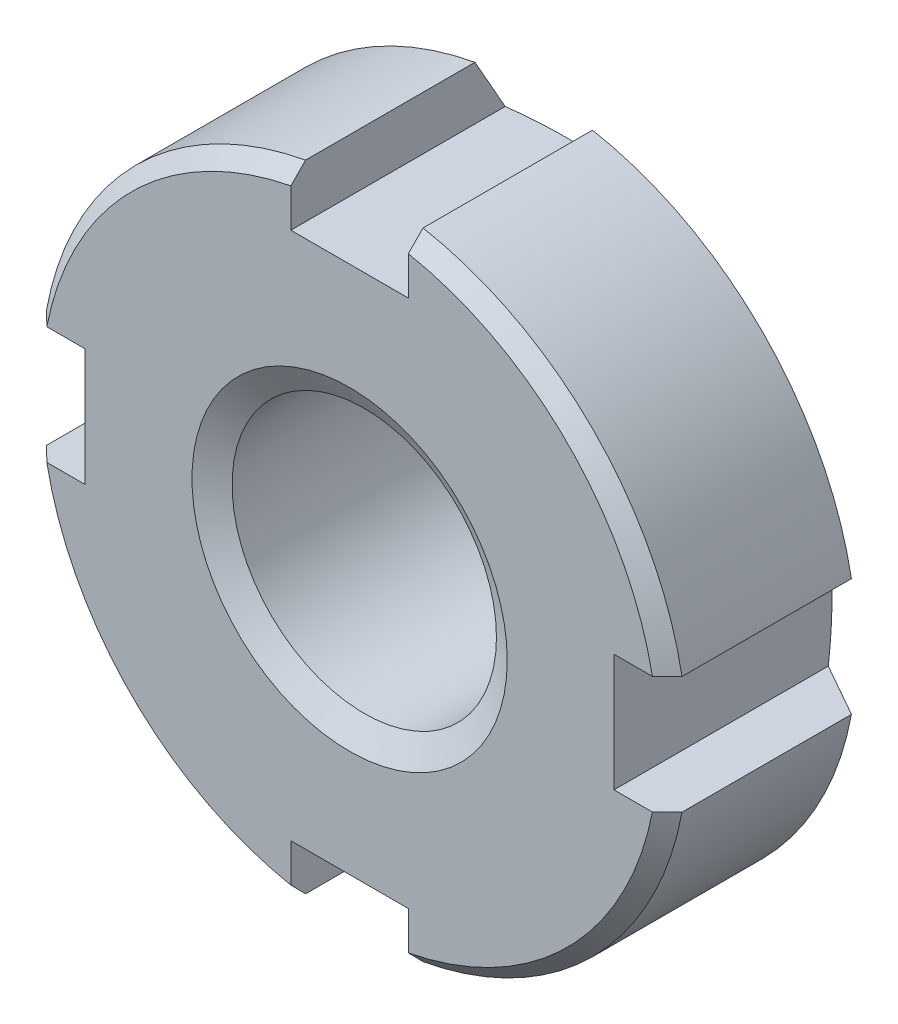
ISO-10303-21;
HEADER;
FILE_DESCRIPTION(('STEP AP214'),'2;1');
FILE_NAME('part.step','',(''),(''),'','','');
FILE_SCHEMA(('AUTOMOTIVE_DESIGN { 1 0 10303 214 1 1 1 1 }'));
ENDSEC;
DATA;
#1=APPLICATION_CONTEXT('core data for automotive mechanical design processes');
#2=APPLICATION_PROTOCOL_DEFINITION('international standard','automotive_design',2000,#1);
#3=PRODUCT_CONTEXT('',#1,'mechanical');
#4=PRODUCT('Part','Part','',(#3));
#5=PRODUCT_RELATED_PRODUCT_CATEGORY('part','',(#4));
#6=PRODUCT_DEFINITION_FORMATION('','',#4);
#7=PRODUCT_DEFINITION_CONTEXT('part definition',#1,'design');
#8=PRODUCT_DEFINITION('design','',#6,#7);
#9=PRODUCT_DEFINITION_SHAPE('','',#8);
#10=(LENGTH_UNIT() NAMED_UNIT(*) SI_UNIT(.MILLI.,.METRE.));
#11=(NAMED_UNIT(*) PLANE_ANGLE_UNIT() SI_UNIT($,.RADIAN.));
#12=(NAMED_UNIT(*) SI_UNIT($,.STERADIAN.) SOLID_ANGLE_UNIT());
#13=UNCERTAINTY_MEASURE_WITH_UNIT(LENGTH_MEASURE(1.E-05),#10,'distance_accuracy_value','');
#14=(GEOMETRIC_REPRESENTATION_CONTEXT(3) GLOBAL_UNCERTAINTY_ASSIGNED_CONTEXT((#13)) GLOBAL_UNIT_ASSIGNED_CONTEXT((#10,
#11,#12)) REPRESENTATION_CONTEXT('',''));
#15=CARTESIAN_POINT('',(0.,0.,0.));
#16=DIRECTION('',(0.,0.,1.));
#17=DIRECTION('',(1.,0.,0.));
#18=AXIS2_PLACEMENT_3D('',#15,#16,#17);
#19=CARTESIAN_POINT('',(0.,0.,-8.));
#20=DIRECTION('',(0.,0.,1.));
#21=DIRECTION('',(1.,0.,0.));
#22=AXIS2_PLACEMENT_3D('',#19,#20,#21);
#23=CYLINDRICAL_SURFACE('',#22,11.);
#24=DIRECTION('',(0.,0.,-1.));
#25=VECTOR('',#24,1.);
#26=CARTESIAN_POINT('',(-10.8166538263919,-2.00000000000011,0.));
#27=LINE('',#26,#25);
#28=CARTESIAN_POINT('',(-10.8166538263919,-2.00000000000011,-0.5));
#29=VERTEX_POINT('',#28);
#30=CARTESIAN_POINT('',(-10.8166538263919,-2.00000000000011,-6.26794919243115));
#31=VERTEX_POINT('',#30);
#32=EDGE_CURVE('E200',#29,#31,#27,.T.);
#33=ORIENTED_EDGE('',*,*,#32,.T.);
#34=CARTESIAN_POINT('',(0.,0.,-6.26794919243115));
#35=DIRECTION('',(0.,0.,-1.));
#36=DIRECTION('',(-1.,0.,0.));
#37=AXIS2_PLACEMENT_3D('',#34,#35,#36);
#38=CIRCLE('',#37,11.);
#39=CARTESIAN_POINT('',(-2.,-10.816653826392,-6.26794919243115));
#40=VERTEX_POINT('',#39);
#41=EDGE_CURVE('E485',#40,#31,#38,.T.);
#42=ORIENTED_EDGE('',*,*,#41,.F.);
#43=DIRECTION('',(0.,0.,-1.));
#44=VECTOR('',#43,1.);
#45=CARTESIAN_POINT('',(-2.,-10.816653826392,0.));
#46=LINE('',#45,#44);
#47=CARTESIAN_POINT('',(-2.,-10.816653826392,-0.5));
#48=VERTEX_POINT('',#47);
#49=EDGE_CURVE('E465',#48,#40,#46,.T.);
#50=ORIENTED_EDGE('',*,*,#49,.F.);
#51=CARTESIAN_POINT('',(0.,0.,-0.500000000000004));
#52=DIRECTION('',(0.,0.,1.));
#53=DIRECTION('',(1.,0.,0.));
#54=AXIS2_PLACEMENT_3D('',#51,#52,#53);
#55=CIRCLE('',#54,11.);
#56=EDGE_CURVE('E520',#48,#29,#55,.F.);
#57=ORIENTED_EDGE('',*,*,#56,.T.);
#58=EDGE_LOOP('',(#33,#42,#50,#57));
#59=FACE_BOUND('',#58,.T.);
#60=ADVANCED_FACE('F41',(#59),#23,.T.);
#61=CARTESIAN_POINT('',(0.,0.,0.));
#62=DIRECTION('',(0.,0.,-1.));
#63=DIRECTION('',(-1.,0.,0.));
#64=AXIS2_PLACEMENT_3D('',#61,#62,#63);
#65=CONICAL_SURFACE('',#64,10.5,0.785398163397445);
#66=CARTESIAN_POINT('',(-13.1380677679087,-2.00000000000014,-2.78942529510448));
#67=CARTESIAN_POINT('',(-12.7116462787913,-2.00000000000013,-2.36789004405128));
#68=CARTESIAN_POINT('',(-12.2850202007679,-2.00000000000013,-1.94656116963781));
#69=CARTESIAN_POINT('',(-11.4311341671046,-2.00000000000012,-1.10455061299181));
#70=CARTESIAN_POINT('',(-11.0038742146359,-2.00000000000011,-0.68386892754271));
#71=CARTESIAN_POINT('',(-10.148490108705,-2.0000000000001,0.156618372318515));
#72=CARTESIAN_POINT('',(-9.7203659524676,-2.0000000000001,0.576423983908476));
#73=CARTESIAN_POINT('',(-9.07722771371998,-2.00000000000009,1.20516089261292));
#74=CARTESIAN_POINT('',(-8.86268909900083,-2.00000000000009,1.41457846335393));
#75=CARTESIAN_POINT('',(-8.43321406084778,-2.00000000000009,1.83300575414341));
#76=CARTESIAN_POINT('',(-8.2182776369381,-2.00000000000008,2.04201547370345));
#77=CARTESIAN_POINT('',(-8.00310215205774,-2.00000000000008,2.25077918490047));
#78=B_SPLINE_CURVE_WITH_KNOTS('',3,(#66,#67,#68,#69,#70,#71,#72,#73,#74,#75,#76,#77),
.UNSPECIFIED.,.F.,.F.,(4,2,2,2,2,4),(0.,1.7988182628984,3.59762755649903,5.39644263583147,
6.29585464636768,7.19526773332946),.UNSPECIFIED.);
#79=CARTESIAN_POINT('',(-10.3077640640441,-2.00000000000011,0.));
#80=VERTEX_POINT('',#79);
#81=EDGE_CURVE('E224',#29,#80,#78,.T.);
#82=ORIENTED_EDGE('',*,*,#81,.F.);
#83=ORIENTED_EDGE('',*,*,#56,.F.);
#84=CARTESIAN_POINT('',(-2.,-8.00310215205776,2.25077918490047));
#85=CARTESIAN_POINT('',(-2.,-8.21827763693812,2.04201547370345));
#86=CARTESIAN_POINT('',(-2.,-8.43321406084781,1.83300575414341));
#87=CARTESIAN_POINT('',(-2.,-8.86268909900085,1.41457846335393));
#88=CARTESIAN_POINT('',(-2.,-9.07722771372,1.20516089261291));
#89=CARTESIAN_POINT('',(-2.,-9.72036595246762,0.576423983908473));
#90=CARTESIAN_POINT('',(-2.,-10.1484901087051,0.156618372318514));
#91=CARTESIAN_POINT('',(-2.,-11.003874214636,-0.68386892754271));
#92=CARTESIAN_POINT('',(-2.,-11.4311341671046,-1.10455061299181));
#93=CARTESIAN_POINT('',(-2.,-12.2850202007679,-1.94656116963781));
#94=CARTESIAN_POINT('',(-2.,-12.7116462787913,-2.36789004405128));
#95=CARTESIAN_POINT('',(-2.,-13.1380677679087,-2.78942529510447));
#96=B_SPLINE_CURVE_WITH_KNOTS('',3,(#84,#85,#86,#87,#88,#89,#90,#91,#92,#93,#94,#95),
.UNSPECIFIED.,.F.,.F.,(4,2,2,2,2,4),(0.,0.899413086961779,1.79882509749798,3.59764017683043,
5.39644947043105,7.19526773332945),.UNSPECIFIED.);
#97=CARTESIAN_POINT('',(-2.,-10.3077640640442,0.));
#98=VERTEX_POINT('',#97);
#99=EDGE_CURVE('E431',#98,#48,#96,.T.);
#100=ORIENTED_EDGE('',*,*,#99,.F.);
#101=CARTESIAN_POINT('',(0.,0.,0.));
#102=DIRECTION('',(0.,0.,1.));
#103=DIRECTION('',(1.,0.,0.));
#104=AXIS2_PLACEMENT_3D('',#101,#102,#103);
#105=CIRCLE('',#104,10.5);
#106=EDGE_CURVE('E490',#80,#98,#105,.T.);
#107=ORIENTED_EDGE('',*,*,#106,.F.);
#108=EDGE_LOOP('',(#82,#83,#100,#107));
#109=FACE_BOUND('',#108,.T.);
#110=ADVANCED_FACE('F546',(#109),#65,.T.);
#111=DIRECTION('',(0.,0.,-1.));
#112=VECTOR('',#111,1.);
#113=CARTESIAN_POINT('',(-10.816653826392,1.99999999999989,0.));
#114=LINE('',#113,#112);
#115=CARTESIAN_POINT('',(-10.816653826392,1.99999999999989,-0.5));
#116=VERTEX_POINT('',#115);
#117=CARTESIAN_POINT('',(-10.816653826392,1.99999999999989,-6.26794919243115));
#118=VERTEX_POINT('',#117);
#119=EDGE_CURVE('E62',#116,#118,#114,.T.);
#120=ORIENTED_EDGE('',*,*,#119,.F.);
#121=CARTESIAN_POINT('',(-2.00000000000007,10.816653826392,-0.5));
#122=VERTEX_POINT('',#121);
#123=EDGE_CURVE('E503',#116,#122,#55,.F.);
#124=ORIENTED_EDGE('',*,*,#123,.T.);
#125=DIRECTION('',(0.,0.,-1.));
#126=VECTOR('',#125,1.);
#127=CARTESIAN_POINT('',(-2.00000000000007,10.816653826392,0.));
#128=LINE('',#127,#126);
#129=CARTESIAN_POINT('',(-2.00000000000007,10.816653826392,-6.26794919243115));
#130=VERTEX_POINT('',#129);
#131=EDGE_CURVE('E360',#122,#130,#128,.T.);
#132=ORIENTED_EDGE('',*,*,#131,.T.);
#133=EDGE_CURVE('E486',#118,#130,#38,.T.);
#134=ORIENTED_EDGE('',*,*,#133,.F.);
#135=EDGE_LOOP('',(#120,#124,#132,#134));
#136=FACE_BOUND('',#135,.T.);
#137=ADVANCED_FACE('F501',(#136),#23,.T.);
#138=CARTESIAN_POINT('',(-8.00310215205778,1.99999999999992,2.25077918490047));
#139=CARTESIAN_POINT('',(-8.21827763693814,1.99999999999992,2.04201547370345));
#140=CARTESIAN_POINT('',(-8.43321406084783,1.99999999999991,1.83300575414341));
#141=CARTESIAN_POINT('',(-8.86268909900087,1.99999999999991,1.41457846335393));
#142=CARTESIAN_POINT('',(-9.07722771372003,1.99999999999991,1.20516089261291));
#143=CARTESIAN_POINT('',(-9.72036595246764,1.9999999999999,0.576423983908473));
#144=CARTESIAN_POINT('',(-10.1484901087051,1.9999999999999,0.156618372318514));
#145=CARTESIAN_POINT('',(-11.003874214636,1.99999999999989,-0.683868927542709));
#146=CARTESIAN_POINT('',(-11.4311341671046,1.99999999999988,-1.10455061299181));
#147=CARTESIAN_POINT('',(-12.2850202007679,1.99999999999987,-1.94656116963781));
#148=CARTESIAN_POINT('',(-12.7116462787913,1.99999999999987,-2.36789004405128));
#149=CARTESIAN_POINT('',(-13.1380677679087,1.99999999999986,-2.78942529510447));
#150=B_SPLINE_CURVE_WITH_KNOTS('',3,(#138,#139,#140,#141,#142,#143,#144,#145,#146,#147,#148,
#149),.UNSPECIFIED.,.F.,.F.,(4,2,2,2,2,4),(0.,0.89941308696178,1.79882509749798,
3.59764017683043,5.39644947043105,7.19526773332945),.UNSPECIFIED.);
#151=CARTESIAN_POINT('',(-10.3077640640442,1.99999999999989,0.));
#152=VERTEX_POINT('',#151);
#153=EDGE_CURVE('E212',#152,#116,#150,.T.);
#154=ORIENTED_EDGE('',*,*,#153,.F.);
#155=CARTESIAN_POINT('',(-2.00000000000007,10.3077640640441,0.));
#156=VERTEX_POINT('',#155);
#157=EDGE_CURVE('E207',#156,#152,#105,.T.);
#158=ORIENTED_EDGE('',*,*,#157,.F.);
#159=CARTESIAN_POINT('',(-2.00000000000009,12.9075072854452,-2.56153682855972));
#160=CARTESIAN_POINT('',(-2.00000000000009,12.4809980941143,-2.14008985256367));
#161=CARTESIAN_POINT('',(-2.00000000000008,12.0542746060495,-1.71885908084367));
#162=CARTESIAN_POINT('',(-2.00000000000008,11.2001558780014,-0.877084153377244));
#163=CARTESIAN_POINT('',(-2.00000000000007,10.7727606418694,-0.456539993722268));
#164=CARTESIAN_POINT('',(-2.00000000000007,9.91704878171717,0.38361390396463));
#165=CARTESIAN_POINT('',(-2.00000000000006,9.48873215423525,0.803223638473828));
#166=CARTESIAN_POINT('',(-2.00000000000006,8.8452332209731,1.4315922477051));
#167=CARTESIAN_POINT('',(-2.00000000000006,8.63056229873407,1.64087471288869));
#168=CARTESIAN_POINT('',(-2.00000000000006,8.20078989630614,2.05899763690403));
#169=CARTESIAN_POINT('',(-2.00000000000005,7.98568841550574,2.26783809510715));
#170=CARTESIAN_POINT('',(-2.00000000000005,7.77032714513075,2.47641078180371));
#171=B_SPLINE_CURVE_WITH_KNOTS('',3,(#159,#160,#161,#162,#163,#164,#165,#166,#167,#168,#169,
#170),.UNSPECIFIED.,.F.,.F.,(4,2,2,2,2,4),(0.,1.79881931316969,3.59762835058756,
5.39644415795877,6.29585718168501,7.19527148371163),.UNSPECIFIED.);
#172=EDGE_CURVE('E358',#122,#156,#171,.T.);
#173=ORIENTED_EDGE('',*,*,#172,.F.);
#174=ORIENTED_EDGE('',*,*,#123,.F.);
#175=EDGE_LOOP('',(#154,#158,#173,#174));
#176=FACE_BOUND('',#175,.T.);
#177=ADVANCED_FACE('F552',(#176),#65,.T.);
#178=DIRECTION('',(0.,0.,-1.));
#179=VECTOR('',#178,1.);
#180=CARTESIAN_POINT('',(1.99999999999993,10.816653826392,0.));
#181=LINE('',#180,#179);
#182=CARTESIAN_POINT('',(1.99999999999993,10.816653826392,-0.5));
#183=VERTEX_POINT('',#182);
#184=CARTESIAN_POINT('',(1.99999999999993,10.816653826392,-6.26794919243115));
#185=VERTEX_POINT('',#184);
#186=EDGE_CURVE('E70',#183,#185,#181,.T.);
#187=ORIENTED_EDGE('',*,*,#186,.F.);
#188=CARTESIAN_POINT('',(10.816653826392,2.00000000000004,-0.5));
#189=VERTEX_POINT('',#188);
#190=EDGE_CURVE('E391',#183,#189,#55,.F.);
#191=ORIENTED_EDGE('',*,*,#190,.T.);
#192=DIRECTION('',(0.,0.,-1.));
#193=VECTOR('',#192,1.);
#194=CARTESIAN_POINT('',(10.816653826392,2.00000000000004,0.));
#195=LINE('',#194,#193);
#196=CARTESIAN_POINT('',(10.816653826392,2.00000000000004,-6.26794919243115));
#197=VERTEX_POINT('',#196);
#198=EDGE_CURVE('E376',#189,#197,#195,.T.);
#199=ORIENTED_EDGE('',*,*,#198,.T.);
#200=EDGE_CURVE('E389',#185,#197,#38,.T.);
#201=ORIENTED_EDGE('',*,*,#200,.F.);
#202=EDGE_LOOP('',(#187,#191,#199,#201));
#203=FACE_BOUND('',#202,.T.);
#204=ADVANCED_FACE('F388',(#203),#23,.T.);
#205=CARTESIAN_POINT('',(1.99999999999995,7.77032714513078,2.47641078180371));
#206=CARTESIAN_POINT('',(1.99999999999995,7.98568841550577,2.26783809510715));
#207=CARTESIAN_POINT('',(1.99999999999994,8.20078989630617,2.05899763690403));
#208=CARTESIAN_POINT('',(1.99999999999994,8.6305622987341,1.64087471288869));
#209=CARTESIAN_POINT('',(1.99999999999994,8.84523322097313,1.4315922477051));
#210=CARTESIAN_POINT('',(1.99999999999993,9.48873215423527,0.803223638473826));
#211=CARTESIAN_POINT('',(1.99999999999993,9.91704878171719,0.383613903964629));
#212=CARTESIAN_POINT('',(1.99999999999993,10.7727606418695,-0.456539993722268));
#213=CARTESIAN_POINT('',(1.99999999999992,11.2001558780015,-0.877084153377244));
#214=CARTESIAN_POINT('',(1.99999999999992,12.0542746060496,-1.71885908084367));
#215=CARTESIAN_POINT('',(1.99999999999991,12.4809980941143,-2.14008985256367));
#216=CARTESIAN_POINT('',(1.99999999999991,12.9075072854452,-2.56153682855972));
#217=B_SPLINE_CURVE_WITH_KNOTS('',3,(#205,#206,#207,#208,#209,#210,#211,#212,#213,#214,#215,
#216),.UNSPECIFIED.,.F.,.F.,(4,2,2,2,2,4),(0.,0.899414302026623,1.79882732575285,
3.59764313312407,5.39645217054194,7.19527148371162),.UNSPECIFIED.);
#218=CARTESIAN_POINT('',(1.99999999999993,10.3077640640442,0.));
#219=VERTEX_POINT('',#218);
#220=EDGE_CURVE('E351',#219,#183,#217,.T.);
#221=ORIENTED_EDGE('',*,*,#220,.F.);
#222=CARTESIAN_POINT('',(10.3077640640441,2.00000000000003,0.));
#223=VERTEX_POINT('',#222);
#224=EDGE_CURVE('E404',#223,#219,#105,.T.);
#225=ORIENTED_EDGE('',*,*,#224,.F.);
#226=CARTESIAN_POINT('',(12.9075072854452,2.00000000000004,-2.56153682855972));
#227=CARTESIAN_POINT('',(12.4809980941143,2.00000000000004,-2.14008985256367));
#228=CARTESIAN_POINT('',(12.0542746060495,2.00000000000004,-1.71885908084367));
#229=CARTESIAN_POINT('',(11.2001558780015,2.00000000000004,-0.877084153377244));
#230=CARTESIAN_POINT('',(10.7727606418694,2.00000000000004,-0.456539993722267));
#231=CARTESIAN_POINT('',(9.91704878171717,2.00000000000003,0.383613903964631));
#232=CARTESIAN_POINT('',(9.48873215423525,2.00000000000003,0.803223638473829));
#233=CARTESIAN_POINT('',(8.84523322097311,2.00000000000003,1.43159224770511));
#234=CARTESIAN_POINT('',(8.63056229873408,2.00000000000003,1.64087471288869));
#235=CARTESIAN_POINT('',(8.20078989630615,2.00000000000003,2.05899763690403));
#236=CARTESIAN_POINT('',(7.98568841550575,2.00000000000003,2.26783809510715));
#237=CARTESIAN_POINT('',(7.77032714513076,2.00000000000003,2.47641078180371));
#238=B_SPLINE_CURVE_WITH_KNOTS('',3,(#226,#227,#228,#229,#230,#231,#232,#233,#234,#235,#236,
#237),.UNSPECIFIED.,.F.,.F.,(4,2,2,2,2,4),(0.,1.79881931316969,3.59762835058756,
5.39644415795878,6.29585718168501,7.19527148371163),.UNSPECIFIED.);
#239=EDGE_CURVE('E397',#189,#223,#238,.T.);
#240=ORIENTED_EDGE('',*,*,#239,.F.);
#241=ORIENTED_EDGE('',*,*,#190,.F.);
#242=EDGE_LOOP('',(#221,#225,#240,#241));
#243=FACE_BOUND('',#242,.T.);
#244=ADVANCED_FACE('F402',(#243),#65,.T.);
#245=DIRECTION('',(0.,0.,-1.));
#246=VECTOR('',#245,1.);
#247=CARTESIAN_POINT('',(10.816653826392,-1.99999999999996,0.));
#248=LINE('',#247,#246);
#249=CARTESIAN_POINT('',(10.816653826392,-1.99999999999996,-0.5));
#250=VERTEX_POINT('',#249);
#251=CARTESIAN_POINT('',(10.816653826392,-1.99999999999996,-6.26794919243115));
#252=VERTEX_POINT('',#251);
#253=EDGE_CURVE('E383',#250,#252,#248,.T.);
#254=ORIENTED_EDGE('',*,*,#253,.F.);
#255=CARTESIAN_POINT('',(2.,-10.816653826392,-0.5));
#256=VERTEX_POINT('',#255);
#257=EDGE_CURVE('E518',#250,#256,#55,.F.);
#258=ORIENTED_EDGE('',*,*,#257,.T.);
#259=DIRECTION('',(0.,0.,-1.));
#260=VECTOR('',#259,1.);
#261=CARTESIAN_POINT('',(2.,-10.816653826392,0.));
#262=LINE('',#261,#260);
#263=CARTESIAN_POINT('',(2.,-10.816653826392,-6.26794919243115));
#264=VERTEX_POINT('',#263);
#265=EDGE_CURVE('E471',#256,#264,#262,.T.);
#266=ORIENTED_EDGE('',*,*,#265,.T.);
#267=EDGE_CURVE('E480',#252,#264,#38,.T.);
#268=ORIENTED_EDGE('',*,*,#267,.F.);
#269=EDGE_LOOP('',(#254,#258,#266,#268));
#270=FACE_BOUND('',#269,.T.);
#271=ADVANCED_FACE('F483',(#270),#23,.T.);
#272=CARTESIAN_POINT('',(0.,0.,-8.));
#273=DIRECTION('',(0.,0.,1.));
#274=DIRECTION('',(1.,0.,0.));
#275=AXIS2_PLACEMENT_3D('',#272,#273,#274);
#276=PLANE('',#275);
#277=CARTESIAN_POINT('',(0.,0.,-8.));
#278=DIRECTION('',(0.,0.,1.));
#279=DIRECTION('',(1.,0.,0.));
#280=AXIS2_PLACEMENT_3D('',#277,#278,#279);
#281=CIRCLE('',#280,5.2);
#282=CARTESIAN_POINT('',(5.2,0.,-8.));
#283=VERTEX_POINT('',#282);
#284=EDGE_CURVE('E528',#283,#283,#281,.T.);
#285=ORIENTED_EDGE('',*,*,#284,.T.);
#286=EDGE_LOOP('',(#285));
#287=FACE_BOUND('',#286,.T.);
#288=CARTESIAN_POINT('',(0.,0.,-8.));
#289=DIRECTION('',(0.,0.,-1.));
#290=DIRECTION('',(-1.,0.,0.));
#291=AXIS2_PLACEMENT_3D('',#288,#289,#290);
#292=CIRCLE('',#291,8.);
#293=CARTESIAN_POINT('',(-8.,0.,-8.));
#294=VERTEX_POINT('',#293);
#295=EDGE_CURVE('E488',#294,#294,#292,.T.);
#296=ORIENTED_EDGE('',*,*,#295,.T.);
#297=EDGE_LOOP('',(#296));
#298=FACE_BOUND('',#297,.T.);
#299=ADVANCED_FACE('F556',(#287,#298),#276,.F.);
#300=CARTESIAN_POINT('',(0.,0.,0.));
#301=DIRECTION('',(0.,0.,1.));
#302=DIRECTION('',(1.,0.,0.));
#303=AXIS2_PLACEMENT_3D('',#300,#301,#302);
#304=PLANE('',#303);
#305=DIRECTION('',(-1.,0.,0.));
#306=VECTOR('',#305,1.);
#307=CARTESIAN_POINT('',(-10.8166538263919,-2.00000000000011,0.));
#308=LINE('',#307,#306);
#309=CARTESIAN_POINT('',(-8.99999999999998,-2.00000000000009,0.));
#310=VERTEX_POINT('',#309);
#311=EDGE_CURVE('E208',#310,#80,#308,.T.);
#312=ORIENTED_EDGE('',*,*,#311,.T.);
#313=ORIENTED_EDGE('',*,*,#106,.T.);
#314=DIRECTION('',(0.,1.,0.));
#315=VECTOR('',#314,1.);
#316=CARTESIAN_POINT('',(-2.,-9.,0.));
#317=LINE('',#316,#315);
#318=CARTESIAN_POINT('',(-2.,-9.,0.));
#319=VERTEX_POINT('',#318);
#320=EDGE_CURVE('E474',#98,#319,#317,.T.);
#321=ORIENTED_EDGE('',*,*,#320,.T.);
#322=DIRECTION('',(1.,0.,0.));
#323=VECTOR('',#322,1.);
#324=CARTESIAN_POINT('',(2.,-9.,0.));
#325=LINE('',#324,#323);
#326=CARTESIAN_POINT('',(2.,-9.,0.));
#327=VERTEX_POINT('',#326);
#328=EDGE_CURVE('E468',#319,#327,#325,.T.);
#329=ORIENTED_EDGE('',*,*,#328,.T.);
#330=DIRECTION('',(0.,-1.,0.));
#331=VECTOR('',#330,1.);
#332=CARTESIAN_POINT('',(2.,-10.816653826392,0.));
#333=LINE('',#332,#331);
#334=CARTESIAN_POINT('',(2.,-10.3077640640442,0.));
#335=VERTEX_POINT('',#334);
#336=EDGE_CURVE('E462',#327,#335,#333,.T.);
#337=ORIENTED_EDGE('',*,*,#336,.T.);
#338=CARTESIAN_POINT('',(10.3077640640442,-1.99999999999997,0.));
#339=VERTEX_POINT('',#338);
#340=EDGE_CURVE('E516',#335,#339,#105,.T.);
#341=ORIENTED_EDGE('',*,*,#340,.T.);
#342=DIRECTION('',(-1.,0.,0.));
#343=VECTOR('',#342,1.);
#344=CARTESIAN_POINT('',(9.,-1.99999999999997,0.));
#345=LINE('',#344,#343);
#346=CARTESIAN_POINT('',(9.,-1.99999999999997,0.));
#347=VERTEX_POINT('',#346);
#348=EDGE_CURVE('E370',#339,#347,#345,.T.);
#349=ORIENTED_EDGE('',*,*,#348,.T.);
#350=DIRECTION('',(0.,1.,0.));
#351=VECTOR('',#350,1.);
#352=CARTESIAN_POINT('',(8.99999999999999,2.00000000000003,0.));
#353=LINE('',#352,#351);
#354=CARTESIAN_POINT('',(8.99999999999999,2.00000000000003,0.));
#355=VERTEX_POINT('',#354);
#356=EDGE_CURVE('E373',#347,#355,#353,.T.);
#357=ORIENTED_EDGE('',*,*,#356,.T.);
#358=DIRECTION('',(1.,0.,0.));
#359=VECTOR('',#358,1.);
#360=CARTESIAN_POINT('',(10.816653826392,2.00000000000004,0.));
#361=LINE('',#360,#359);
#362=EDGE_CURVE('E367',#355,#223,#361,.T.);
#363=ORIENTED_EDGE('',*,*,#362,.T.);
#364=ORIENTED_EDGE('',*,*,#224,.T.);
#365=DIRECTION('',(0.,-1.,0.));
#366=VECTOR('',#365,1.);
#367=CARTESIAN_POINT('',(1.99999999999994,9.00000000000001,0.));
#368=LINE('',#367,#366);
#369=CARTESIAN_POINT('',(1.99999999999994,9.00000000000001,0.));
#370=VERTEX_POINT('',#369);
#371=EDGE_CURVE('E507',#219,#370,#368,.T.);
#372=ORIENTED_EDGE('',*,*,#371,.T.);
#373=DIRECTION('',(-1.,0.,0.));
#374=VECTOR('',#373,1.);
#375=CARTESIAN_POINT('',(-2.00000000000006,8.99999999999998,0.));
#376=LINE('',#375,#374);
#377=CARTESIAN_POINT('',(-2.00000000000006,8.99999999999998,0.));
#378=VERTEX_POINT('',#377);
#379=EDGE_CURVE('E504',#370,#378,#376,.T.);
#380=ORIENTED_EDGE('',*,*,#379,.T.);
#381=DIRECTION('',(0.,1.,0.));
#382=VECTOR('',#381,1.);
#383=CARTESIAN_POINT('',(-2.00000000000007,10.816653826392,0.));
#384=LINE('',#383,#382);
#385=EDGE_CURVE('E511',#378,#156,#384,.T.);
#386=ORIENTED_EDGE('',*,*,#385,.T.);
#387=ORIENTED_EDGE('',*,*,#157,.T.);
#388=DIRECTION('',(1.,0.,0.));
#389=VECTOR('',#388,1.);
#390=CARTESIAN_POINT('',(-9.00000000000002,1.99999999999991,0.));
#391=LINE('',#390,#389);
#392=CARTESIAN_POINT('',(-9.00000000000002,1.99999999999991,0.));
#393=VERTEX_POINT('',#392);
#394=EDGE_CURVE('E186',#152,#393,#391,.T.);
#395=ORIENTED_EDGE('',*,*,#394,.T.);
#396=DIRECTION('',(0.,-1.,0.));
#397=VECTOR('',#396,1.);
#398=CARTESIAN_POINT('',(-8.99999999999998,-2.00000000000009,0.));
#399=LINE('',#398,#397);
#400=EDGE_CURVE('E194',#393,#310,#399,.T.);
#401=ORIENTED_EDGE('',*,*,#400,.T.);
#402=EDGE_LOOP('',(#312,#313,#321,#329,#337,#341,#349,#357,#363,#364,#372,#380,#386,#387,#395,#401));
#403=FACE_BOUND('',#402,.T.);
#404=CARTESIAN_POINT('',(0.,0.,0.));
#405=DIRECTION('',(0.,0.,1.));
#406=DIRECTION('',(1.,0.,0.));
#407=AXIS2_PLACEMENT_3D('',#404,#405,#406);
#408=CIRCLE('',#407,5.36602540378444);
#409=CARTESIAN_POINT('',(5.36602540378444,0.,0.));
#410=VERTEX_POINT('',#409);
#411=EDGE_CURVE('E526',#410,#410,#408,.F.);
#412=ORIENTED_EDGE('',*,*,#411,.T.);
#413=EDGE_LOOP('',(#412));
#414=FACE_BOUND('',#413,.T.);
#415=ADVANCED_FACE('F203',(#403,#414),#304,.T.);
#416=CARTESIAN_POINT('',(0.,0.,-8.));
#417=DIRECTION('',(0.,0.,1.));
#418=DIRECTION('',(1.,0.,0.));
#419=AXIS2_PLACEMENT_3D('',#416,#417,#418);
#420=CYLINDRICAL_SURFACE('',#419,4.5);
#421=CARTESIAN_POINT('',(0.,0.,-7.3));
#422=DIRECTION('',(0.,0.,1.));
#423=DIRECTION('',(1.,0.,0.));
#424=AXIS2_PLACEMENT_3D('',#421,#422,#423);
#425=CIRCLE('',#424,4.5);
#426=CARTESIAN_POINT('',(4.5,0.,-7.3));
#427=VERTEX_POINT('',#426);
#428=EDGE_CURVE('E438',#427,#427,#425,.F.);
#429=ORIENTED_EDGE('',*,*,#428,.T.);
#430=EDGE_LOOP('',(#429));
#431=FACE_BOUND('',#430,.T.);
#432=CARTESIAN_POINT('',(0.,0.,-0.5));
#433=DIRECTION('',(0.,0.,1.));
#434=DIRECTION('',(1.,0.,0.));
#435=AXIS2_PLACEMENT_3D('',#432,#433,#434);
#436=CIRCLE('',#435,4.5);
#437=CARTESIAN_POINT('',(4.5,0.,-0.5));
#438=VERTEX_POINT('',#437);
#439=EDGE_CURVE('E523',#438,#438,#436,.T.);
#440=ORIENTED_EDGE('',*,*,#439,.T.);
#441=EDGE_LOOP('',(#440));
#442=FACE_BOUND('',#441,.T.);
#443=ADVANCED_FACE('F263',(#431,#442),#420,.F.);
#444=CARTESIAN_POINT('',(0.,0.,-6.26794919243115));
#445=DIRECTION('',(0.,0.,1.));
#446=DIRECTION('',(1.,0.,0.));
#447=AXIS2_PLACEMENT_3D('',#444,#445,#446);
#448=CONICAL_SURFACE('',#447,11.,1.0471975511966);
#449=ORIENTED_EDGE('',*,*,#295,.F.);
#450=EDGE_LOOP('',(#449));
#451=FACE_BOUND('',#450,.T.);
#452=ORIENTED_EDGE('',*,*,#41,.T.);
#453=CARTESIAN_POINT('',(-14.5180397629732,-2.00000000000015,-4.15764623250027));
#454=CARTESIAN_POINT('',(-14.1878135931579,-2.00000000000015,-4.34651765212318));
#455=CARTESIAN_POINT('',(-13.857536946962,-2.00000000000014,-4.53530074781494));
#456=CARTESIAN_POINT('',(-13.1968554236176,-2.00000000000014,-4.91264294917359));
#457=CARTESIAN_POINT('',(-12.866450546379,-2.00000000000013,-5.10120205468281));
#458=CARTESIAN_POINT('',(-11.8750106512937,-2.00000000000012,-5.66646781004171));
#459=CARTESIAN_POINT('',(-11.2137430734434,-2.00000000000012,-6.04276707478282));
#460=CARTESIAN_POINT('',(-10.2210665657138,-2.00000000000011,-6.60585872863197));
#461=CARTESIAN_POINT('',(-9.8900432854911,-2.0000000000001,-6.79333082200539));
#462=CARTESIAN_POINT('',(-9.22764882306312,-2.0000000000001,-7.16765827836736));
#463=CARTESIAN_POINT('',(-8.8962776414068,-2.00000000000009,-7.35451364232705));
#464=CARTESIAN_POINT('',(-8.23306446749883,-2.00000000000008,-7.72739667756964));
#465=CARTESIAN_POINT('',(-7.9012224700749,-2.00000000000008,-7.91342433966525));
#466=CARTESIAN_POINT('',(-7.23684820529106,-2.00000000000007,-8.28424663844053));
#467=CARTESIAN_POINT('',(-6.90431593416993,-2.00000000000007,-8.46904126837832));
#468=CARTESIAN_POINT('',(-6.57132877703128,-2.00000000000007,-8.65301673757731));
#469=B_SPLINE_CURVE_WITH_KNOTS('',3,(#453,#454,#455,#456,#457,#458,#459,#460,#461,#462,#463,
#464,#465,#466,#467,#468),.UNSPECIFIED.,.F.,.F.,(4,2,2,2,2,2,2,4),(0.,1.14126920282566,
2.28253920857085,4.56505399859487,5.7063246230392,6.8475934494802,7.98887491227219,
9.13016261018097),.UNSPECIFIED.);
#470=CARTESIAN_POINT('',(-8.99999999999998,-2.00000000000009,-7.29589567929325));
#471=VERTEX_POINT('',#470);
#472=EDGE_CURVE('E11',#31,#471,#469,.T.);
#473=ORIENTED_EDGE('',*,*,#472,.T.);
#474=CARTESIAN_POINT('',(-8.99999999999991,-8.55419893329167,-5.45001984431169));
#475=CARTESIAN_POINT('',(-8.99999999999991,-8.26811578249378,-5.56377412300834));
#476=CARTESIAN_POINT('',(-8.99999999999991,-7.9810073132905,-5.6750070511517));
#477=CARTESIAN_POINT('',(-8.99999999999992,-7.40438644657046,-5.89133370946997));
#478=CARTESIAN_POINT('',(-8.99999999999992,-7.11487330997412,-5.99642546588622));
#479=CARTESIAN_POINT('',(-8.99999999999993,-6.53179842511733,-6.19981325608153));
#480=CARTESIAN_POINT('',(-8.99999999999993,-6.23822359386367,-6.29807214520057));
#481=CARTESIAN_POINT('',(-8.99999999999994,-5.64831476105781,-6.48575369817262));
#482=CARTESIAN_POINT('',(-8.99999999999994,-5.35198099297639,-6.57517710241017));
#483=CARTESIAN_POINT('',(-8.99999999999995,-4.46879431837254,-6.82484752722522));
#484=CARTESIAN_POINT('',(-8.99999999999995,-3.87748484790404,-6.97018736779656));
#485=CARTESIAN_POINT('',(-8.99999999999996,-2.9830200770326,-7.1470513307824));
#486=CARTESIAN_POINT('',(-8.99999999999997,-2.68387585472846,-7.19912117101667));
#487=CARTESIAN_POINT('',(-8.99999999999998,-2.08330390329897,-7.28788620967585));
#488=CARTESIAN_POINT('',(-8.99999999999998,-1.78187650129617,-7.32458356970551));
#489=CARTESIAN_POINT('',(-8.99999999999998,-1.27413100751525,-7.37214566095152));
#490=CARTESIAN_POINT('',(-8.99999999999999,-1.06822679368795,-7.38751860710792));
#491=CARTESIAN_POINT('',(-8.99999999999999,-0.655977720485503,-7.41021211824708));
#492=CARTESIAN_POINT('',(-8.99999999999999,-0.449632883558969,-7.41753308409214));
#493=CARTESIAN_POINT('',(-9.,-0.036764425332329,-7.42397287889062));
#494=CARTESIAN_POINT('',(-9.,0.169759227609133,-7.42308967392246));
#495=CARTESIAN_POINT('',(-9.,0.582610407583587,-7.41313555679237));
#496=CARTESIAN_POINT('',(-9.00000000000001,0.788937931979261,-7.40406453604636));
#497=CARTESIAN_POINT('',(-9.00000000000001,1.20192608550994,-7.37786286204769));
#498=CARTESIAN_POINT('',(-9.00000000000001,1.40858462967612,-7.36069942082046));
#499=CARTESIAN_POINT('',(-9.00000000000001,1.82111619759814,-7.31863849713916));
#500=CARTESIAN_POINT('',(-9.00000000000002,2.02698916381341,-7.29374045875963));
#501=CARTESIAN_POINT('',(-9.00000000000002,2.64301380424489,-7.20810672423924));
#502=CARTESIAN_POINT('',(-9.00000000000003,3.05167696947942,-7.1364242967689));
#503=CARTESIAN_POINT('',(-9.00000000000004,3.81904073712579,-6.9775550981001));
#504=CARTESIAN_POINT('',(-9.00000000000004,4.17829071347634,-6.89294247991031));
#505=CARTESIAN_POINT('',(-9.00000000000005,4.89256535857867,-6.70735930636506));
#506=CARTESIAN_POINT('',(-9.00000000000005,5.24758940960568,-6.60638639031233));
#507=CARTESIAN_POINT('',(-9.00000000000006,5.9541329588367,-6.39086683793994));
#508=CARTESIAN_POINT('',(-9.00000000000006,6.3056452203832,-6.27629671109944));
#509=CARTESIAN_POINT('',(-9.00000000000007,7.00488039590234,-6.03626611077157));
#510=CARTESIAN_POINT('',(-9.00000000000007,7.35260356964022,-5.91080638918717));
#511=CARTESIAN_POINT('',(-9.00000000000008,8.04280198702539,-5.65177798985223));
#512=CARTESIAN_POINT('',(-9.00000000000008,8.38529563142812,-5.51825808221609));
#513=CARTESIAN_POINT('',(-9.00000000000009,9.06743318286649,-5.24410594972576));
#514=CARTESIAN_POINT('',(-9.00000000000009,9.40707695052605,-5.10347337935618));
#515=CARTESIAN_POINT('',(-9.0000000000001,10.0823328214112,-4.81706970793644));
#516=CARTESIAN_POINT('',(-9.0000000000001,10.4179562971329,-4.67132531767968));
#517=CARTESIAN_POINT('',(-9.00000000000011,11.0870298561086,-4.37508355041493));
#518=CARTESIAN_POINT('',(-9.00000000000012,11.420480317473,-4.22458702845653));
#519=CARTESIAN_POINT('',(-9.00000000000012,11.7530410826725,-4.07218538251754));
#520=B_SPLINE_CURVE_WITH_KNOTS('',3,(#474,#475,#476,#477,#478,#479,#480,#481,#482,#483,#484,
#485,#486,#487,#488,#489,#490,#491,#492,#493,#494,#495,#496,#497,#498,#499,#500,#501,#502,#503,
#504,#505,#506,#507,#508,#509,#510,#511,#512,#513,#514,#515,#516,#517,#518,#519),.UNSPECIFIED.,
.F.,.F.,(4,2,2,2,2,2,2,2,2,2,2,2,2,2,2,2,2,2,2,2,2,2,4),(0.,0.923625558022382,1.84754635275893,
2.77615012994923,3.70467602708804,5.52903466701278,6.43964717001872,7.35013158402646,
7.96942220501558,8.58868199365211,9.20809530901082,9.82751683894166,10.4494699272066,
11.0714677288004,12.3151461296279,13.4219675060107,14.5289487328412,15.6378710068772,
16.7467167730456,17.849420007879,18.9521768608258,20.0498442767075,21.1473153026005),.UNSPECIFIED.);
#521=CARTESIAN_POINT('',(-9.00000000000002,1.99999999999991,-7.29589567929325));
#522=VERTEX_POINT('',#521);
#523=EDGE_CURVE('E55',#471,#522,#520,.T.);
#524=ORIENTED_EDGE('',*,*,#523,.T.);
#525=CARTESIAN_POINT('',(-6.57132877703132,1.99999999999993,-8.65301673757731));
#526=CARTESIAN_POINT('',(-6.90431593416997,1.99999999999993,-8.46904126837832));
#527=CARTESIAN_POINT('',(-7.2368482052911,1.99999999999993,-8.28424663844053));
#528=CARTESIAN_POINT('',(-7.90122247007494,1.99999999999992,-7.91342433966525));
#529=CARTESIAN_POINT('',(-8.23306446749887,1.99999999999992,-7.72739667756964));
#530=CARTESIAN_POINT('',(-8.89627764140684,1.99999999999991,-7.35451364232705));
#531=CARTESIAN_POINT('',(-9.22764882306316,1.9999999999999,-7.16765827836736));
#532=CARTESIAN_POINT('',(-9.89004328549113,1.9999999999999,-6.7933308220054));
#533=CARTESIAN_POINT('',(-10.2210665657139,1.99999999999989,-6.60585872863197));
#534=CARTESIAN_POINT('',(-11.2137430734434,1.99999999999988,-6.04276707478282));
#535=CARTESIAN_POINT('',(-11.8750106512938,1.99999999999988,-5.66646781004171));
#536=CARTESIAN_POINT('',(-12.866450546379,1.99999999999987,-5.10120205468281));
#537=CARTESIAN_POINT('',(-13.1968554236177,1.99999999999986,-4.91264294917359));
#538=CARTESIAN_POINT('',(-13.8575369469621,1.99999999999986,-4.53530074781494));
#539=CARTESIAN_POINT('',(-14.187813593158,1.99999999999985,-4.34651765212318));
#540=CARTESIAN_POINT('',(-14.5180397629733,1.99999999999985,-4.15764623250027));
#541=B_SPLINE_CURVE_WITH_KNOTS('',3,(#525,#526,#527,#528,#529,#530,#531,#532,#533,#534,#535,
#536,#537,#538,#539,#540),.UNSPECIFIED.,.F.,.F.,(4,2,2,2,2,2,2,4),(0.,1.14128769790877,
2.28256916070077,3.42383798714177,4.5651086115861,6.84762340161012,7.9888934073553,
9.13016261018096),.UNSPECIFIED.);
#542=EDGE_CURVE('E188',#522,#118,#541,.T.);
#543=ORIENTED_EDGE('',*,*,#542,.T.);
#544=ORIENTED_EDGE('',*,*,#133,.T.);
#545=CARTESIAN_POINT('',(-2.00000000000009,13.1183891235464,-4.95738076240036));
#546=CARTESIAN_POINT('',(-2.00000000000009,12.7879875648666,-5.14595360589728));
#547=CARTESIAN_POINT('',(-2.00000000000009,12.4575208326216,-5.3344124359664));
#548=CARTESIAN_POINT('',(-2.00000000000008,11.7964107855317,-5.71102033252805));
#549=CARTESIAN_POINT('',(-2.00000000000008,11.4657674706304,-5.89916939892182));
#550=CARTESIAN_POINT('',(-2.00000000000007,10.8042674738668,-6.27507066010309));
#551=CARTESIAN_POINT('',(-2.00000000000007,10.4734107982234,-6.46282286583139));
#552=CARTESIAN_POINT('',(-2.00000000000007,9.81140447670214,-6.83781182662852));
#553=CARTESIAN_POINT('',(-2.00000000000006,9.48025483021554,-7.02504858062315));
#554=CARTESIAN_POINT('',(-2.00000000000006,8.8175528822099,-7.39883347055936));
#555=CARTESIAN_POINT('',(-2.00000000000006,8.48600056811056,-7.58538158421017));
#556=CARTESIAN_POINT('',(-2.00000000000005,7.82235446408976,-7.95750863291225));
#557=CARTESIAN_POINT('',(-2.00000000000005,7.49026067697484,-8.14308757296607));
#558=CARTESIAN_POINT('',(-2.00000000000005,6.82528475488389,-8.51285331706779));
#559=CARTESIAN_POINT('',(-2.00000000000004,6.49240259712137,-8.69704008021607));
#560=CARTESIAN_POINT('',(-2.00000000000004,5.99219337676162,-8.97171456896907));
#561=CARTESIAN_POINT('',(-2.00000000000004,5.82530786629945,-9.06300590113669));
#562=CARTESIAN_POINT('',(-2.00000000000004,5.49115779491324,-9.2448943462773));
#563=CARTESIAN_POINT('',(-2.00000000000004,5.3238932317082,-9.33549145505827));
#564=CARTESIAN_POINT('',(-2.00000000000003,5.15639781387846,-9.425661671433));
#565=B_SPLINE_CURVE_WITH_KNOTS('',3,(#545,#546,#547,#548,#549,#550,#551,#552,#553,#554,#555,
#556,#557,#558,#559,#560,#561,#562,#563,#564),.UNSPECIFIED.,.F.,.F.,(4,2,2,2,2,2,2,2,2,4),(0.,
1.14128191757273,2.2825641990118,3.42381459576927,4.56506736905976,5.70635676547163,
6.84764026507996,7.9889571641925,8.55962543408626,9.13029714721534),.UNSPECIFIED.);
#566=CARTESIAN_POINT('',(-2.00000000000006,8.99999999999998,-7.29589567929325));
#567=VERTEX_POINT('',#566);
#568=EDGE_CURVE('E247',#130,#567,#565,.T.);
#569=ORIENTED_EDGE('',*,*,#568,.T.);
#570=CARTESIAN_POINT('',(-8.55419893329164,8.99999999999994,-5.45001984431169));
#571=CARTESIAN_POINT('',(-8.26811578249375,8.99999999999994,-5.56377412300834));
#572=CARTESIAN_POINT('',(-7.98100731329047,8.99999999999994,-5.6750070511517));
#573=CARTESIAN_POINT('',(-7.40438644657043,8.99999999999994,-5.89133370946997));
#574=CARTESIAN_POINT('',(-7.11487330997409,8.99999999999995,-5.99642546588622));
#575=CARTESIAN_POINT('',(-6.5317984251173,8.99999999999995,-6.19981325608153));
#576=CARTESIAN_POINT('',(-6.23822359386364,8.99999999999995,-6.29807214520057));
#577=CARTESIAN_POINT('',(-5.64831476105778,8.99999999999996,-6.48575369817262));
#578=CARTESIAN_POINT('',(-5.35198099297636,8.99999999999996,-6.57517710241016));
#579=CARTESIAN_POINT('',(-4.46879431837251,8.99999999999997,-6.82484752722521));
#580=CARTESIAN_POINT('',(-3.87748484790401,8.99999999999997,-6.97018736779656));
#581=CARTESIAN_POINT('',(-2.98302007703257,8.99999999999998,-7.1470513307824));
#582=CARTESIAN_POINT('',(-2.68387585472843,8.99999999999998,-7.19912117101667));
#583=CARTESIAN_POINT('',(-2.08330390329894,8.99999999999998,-7.28788620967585));
#584=CARTESIAN_POINT('',(-1.78187650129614,8.99999999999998,-7.32458356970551));
#585=CARTESIAN_POINT('',(-1.27413100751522,8.99999999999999,-7.37214566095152));
#586=CARTESIAN_POINT('',(-1.06822679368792,8.99999999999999,-7.38751860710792));
#587=CARTESIAN_POINT('',(-0.655977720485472,8.99999999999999,-7.41021211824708));
#588=CARTESIAN_POINT('',(-0.449632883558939,8.99999999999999,-7.41753308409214));
#589=CARTESIAN_POINT('',(-0.0367644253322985,9.,-7.42397287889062));
#590=CARTESIAN_POINT('',(0.169759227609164,9.,-7.42308967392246));
#591=CARTESIAN_POINT('',(0.582610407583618,9.,-7.41313555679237));
#592=CARTESIAN_POINT('',(0.788937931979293,9.,-7.40406453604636));
#593=CARTESIAN_POINT('',(1.20192608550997,9.00000000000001,-7.37786286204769));
#594=CARTESIAN_POINT('',(1.40858462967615,9.00000000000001,-7.36069942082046));
#595=CARTESIAN_POINT('',(1.82111619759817,9.00000000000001,-7.31863849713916));
#596=CARTESIAN_POINT('',(2.02698916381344,9.00000000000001,-7.29374045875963));
#597=CARTESIAN_POINT('',(2.64301380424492,9.00000000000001,-7.20810672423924));
#598=CARTESIAN_POINT('',(3.05167696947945,9.00000000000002,-7.1364242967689));
#599=CARTESIAN_POINT('',(3.81904073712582,9.00000000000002,-6.9775550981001));
#600=CARTESIAN_POINT('',(4.17829071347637,9.00000000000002,-6.89294247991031));
#601=CARTESIAN_POINT('',(4.8925653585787,9.00000000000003,-6.70735930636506));
#602=CARTESIAN_POINT('',(5.2475894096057,9.00000000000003,-6.60638639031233));
#603=CARTESIAN_POINT('',(5.95413295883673,9.00000000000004,-6.39086683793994));
#604=CARTESIAN_POINT('',(6.30564522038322,9.00000000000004,-6.27629671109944));
#605=CARTESIAN_POINT('',(7.00488039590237,9.00000000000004,-6.03626611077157));
#606=CARTESIAN_POINT('',(7.35260356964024,9.00000000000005,-5.91080638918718));
#607=CARTESIAN_POINT('',(8.04280198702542,9.00000000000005,-5.65177798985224));
#608=CARTESIAN_POINT('',(8.38529563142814,9.00000000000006,-5.5182580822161));
#609=CARTESIAN_POINT('',(9.06743318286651,9.00000000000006,-5.24410594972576));
#610=CARTESIAN_POINT('',(9.40707695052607,9.00000000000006,-5.10347337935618));
#611=CARTESIAN_POINT('',(10.0823328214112,9.00000000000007,-4.81706970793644));
#612=CARTESIAN_POINT('',(10.4179562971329,9.00000000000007,-4.67132531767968));
#613=CARTESIAN_POINT('',(11.0870298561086,9.00000000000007,-4.37508355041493));
#614=CARTESIAN_POINT('',(11.4204803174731,9.00000000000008,-4.22458702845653));
#615=CARTESIAN_POINT('',(11.7530410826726,9.00000000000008,-4.07218538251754));
#616=B_SPLINE_CURVE_WITH_KNOTS('',3,(#570,#571,#572,#573,#574,#575,#576,#577,#578,#579,#580,
#581,#582,#583,#584,#585,#586,#587,#588,#589,#590,#591,#592,#593,#594,#595,#596,#597,#598,#599,
#600,#601,#602,#603,#604,#605,#606,#607,#608,#609,#610,#611,#612,#613,#614,#615),.UNSPECIFIED.,
.F.,.F.,(4,2,2,2,2,2,2,2,2,2,2,2,2,2,2,2,2,2,2,2,2,2,4),(0.,0.923625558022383,1.84754635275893,
2.77615012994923,3.70467602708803,5.52903466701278,6.43964717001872,7.35013158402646,
7.96942220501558,8.58868199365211,9.20809530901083,9.82751683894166,10.4494699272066,
11.0714677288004,12.3151461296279,13.4219675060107,14.5289487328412,15.6378710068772,
16.7467167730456,17.849420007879,18.9521768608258,20.0498442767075,21.1473153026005),.UNSPECIFIED.);
#617=CARTESIAN_POINT('',(1.99999999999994,9.00000000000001,-7.29589567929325));
#618=VERTEX_POINT('',#617);
#619=EDGE_CURVE('E333',#567,#618,#616,.T.);
#620=ORIENTED_EDGE('',*,*,#619,.T.);
#621=CARTESIAN_POINT('',(1.99999999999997,5.15639781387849,-9.425661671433));
#622=CARTESIAN_POINT('',(1.99999999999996,5.32389323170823,-9.33549145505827));
#623=CARTESIAN_POINT('',(1.99999999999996,5.49115779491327,-9.2448943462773));
#624=CARTESIAN_POINT('',(1.99999999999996,5.82530786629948,-9.06300590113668));
#625=CARTESIAN_POINT('',(1.99999999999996,5.99219337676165,-8.97171456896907));
#626=CARTESIAN_POINT('',(1.99999999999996,6.4924025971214,-8.69704008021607));
#627=CARTESIAN_POINT('',(1.99999999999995,6.82528475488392,-8.51285331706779));
#628=CARTESIAN_POINT('',(1.99999999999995,7.49026067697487,-8.14308757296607));
#629=CARTESIAN_POINT('',(1.99999999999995,7.82235446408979,-7.95750863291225));
#630=CARTESIAN_POINT('',(1.99999999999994,8.48600056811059,-7.58538158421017));
#631=CARTESIAN_POINT('',(1.99999999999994,8.81755288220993,-7.39883347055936));
#632=CARTESIAN_POINT('',(1.99999999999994,9.48025483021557,-7.02504858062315));
#633=CARTESIAN_POINT('',(1.99999999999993,9.81140447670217,-6.83781182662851));
#634=CARTESIAN_POINT('',(1.99999999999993,10.4734107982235,-6.46282286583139));
#635=CARTESIAN_POINT('',(1.99999999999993,10.8042674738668,-6.27507066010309));
#636=CARTESIAN_POINT('',(1.99999999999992,11.4657674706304,-5.89916939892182));
#637=CARTESIAN_POINT('',(1.99999999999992,11.7964107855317,-5.71102033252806));
#638=CARTESIAN_POINT('',(1.99999999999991,12.4575208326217,-5.3344124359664));
#639=CARTESIAN_POINT('',(1.99999999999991,12.7879875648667,-5.14595360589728));
#640=CARTESIAN_POINT('',(1.99999999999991,13.1183891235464,-4.95738076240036));
#641=B_SPLINE_CURVE_WITH_KNOTS('',3,(#621,#622,#623,#624,#625,#626,#627,#628,#629,#630,#631,
#632,#633,#634,#635,#636,#637,#638,#639,#640),.UNSPECIFIED.,.F.,.F.,(4,2,2,2,2,2,2,2,2,4),(0.,
0.570671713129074,1.14133998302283,2.28265688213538,3.4239403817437,4.56522977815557,
5.70648255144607,6.84773294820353,7.9890152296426,9.13029714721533),.UNSPECIFIED.);
#642=EDGE_CURVE('E326',#618,#185,#641,.T.);
#643=ORIENTED_EDGE('',*,*,#642,.T.);
#644=ORIENTED_EDGE('',*,*,#200,.T.);
#645=CARTESIAN_POINT('',(13.1183891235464,2.00000000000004,-4.95738076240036));
#646=CARTESIAN_POINT('',(12.7879875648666,2.00000000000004,-5.14595360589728));
#647=CARTESIAN_POINT('',(12.4575208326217,2.00000000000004,-5.3344124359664));
#648=CARTESIAN_POINT('',(11.7964107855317,2.00000000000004,-5.71102033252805));
#649=CARTESIAN_POINT('',(11.4657674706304,2.00000000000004,-5.89916939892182));
#650=CARTESIAN_POINT('',(10.8042674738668,2.00000000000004,-6.27507066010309));
#651=CARTESIAN_POINT('',(10.4734107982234,2.00000000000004,-6.46282286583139));
#652=CARTESIAN_POINT('',(9.81140447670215,2.00000000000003,-6.83781182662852));
#653=CARTESIAN_POINT('',(9.48025483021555,2.00000000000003,-7.02504858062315));
#654=CARTESIAN_POINT('',(8.8175528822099,2.00000000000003,-7.39883347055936));
#655=CARTESIAN_POINT('',(8.48600056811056,2.00000000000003,-7.58538158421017));
#656=CARTESIAN_POINT('',(7.82235446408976,2.00000000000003,-7.95750863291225));
#657=CARTESIAN_POINT('',(7.49026067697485,2.00000000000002,-8.14308757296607));
#658=CARTESIAN_POINT('',(6.82528475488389,2.00000000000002,-8.51285331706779));
#659=CARTESIAN_POINT('',(6.49240259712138,2.00000000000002,-8.69704008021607));
#660=CARTESIAN_POINT('',(5.99219337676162,2.00000000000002,-8.97171456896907));
#661=CARTESIAN_POINT('',(5.82530786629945,2.00000000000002,-9.06300590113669));
#662=CARTESIAN_POINT('',(5.49115779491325,2.00000000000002,-9.2448943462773));
#663=CARTESIAN_POINT('',(5.32389323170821,2.00000000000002,-9.33549145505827));
#664=CARTESIAN_POINT('',(5.15639781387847,2.00000000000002,-9.425661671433));
#665=B_SPLINE_CURVE_WITH_KNOTS('',3,(#645,#646,#647,#648,#649,#650,#651,#652,#653,#654,#655,
#656,#657,#658,#659,#660,#661,#662,#663,#664),.UNSPECIFIED.,.F.,.F.,(4,2,2,2,2,2,2,2,2,4),(0.,
1.14128191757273,2.2825641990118,3.42381459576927,4.56506736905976,5.70635676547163,
6.84764026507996,7.9889571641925,8.55962543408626,9.13029714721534),.UNSPECIFIED.);
#666=CARTESIAN_POINT('',(8.99999999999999,2.00000000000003,-7.29589567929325));
#667=VERTEX_POINT('',#666);
#668=EDGE_CURVE('E308',#197,#667,#665,.T.);
#669=ORIENTED_EDGE('',*,*,#668,.T.);
#670=CARTESIAN_POINT('',(9.00000000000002,-8.55419893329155,-5.45001984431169));
#671=CARTESIAN_POINT('',(9.00000000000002,-8.26811578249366,-5.56377412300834));
#672=CARTESIAN_POINT('',(9.00000000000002,-7.98100731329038,-5.6750070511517));
#673=CARTESIAN_POINT('',(9.00000000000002,-7.40438644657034,-5.89133370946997));
#674=CARTESIAN_POINT('',(9.00000000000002,-7.114873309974,-5.99642546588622));
#675=CARTESIAN_POINT('',(9.00000000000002,-6.53179842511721,-6.19981325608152));
#676=CARTESIAN_POINT('',(9.00000000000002,-6.23822359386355,-6.29807214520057));
#677=CARTESIAN_POINT('',(9.00000000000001,-5.64831476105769,-6.48575369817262));
#678=CARTESIAN_POINT('',(9.00000000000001,-5.35198099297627,-6.57517710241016));
#679=CARTESIAN_POINT('',(9.00000000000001,-4.46879431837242,-6.82484752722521));
#680=CARTESIAN_POINT('',(9.00000000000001,-3.87748484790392,-6.97018736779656));
#681=CARTESIAN_POINT('',(9.00000000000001,-2.98302007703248,-7.1470513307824));
#682=CARTESIAN_POINT('',(9.00000000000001,-2.68387585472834,-7.19912117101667));
#683=CARTESIAN_POINT('',(9.,-2.08330390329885,-7.28788620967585));
#684=CARTESIAN_POINT('',(9.,-1.78187650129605,-7.32458356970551));
#685=CARTESIAN_POINT('',(9.,-1.27413100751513,-7.37214566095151));
#686=CARTESIAN_POINT('',(9.,-1.06822679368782,-7.38751860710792));
#687=CARTESIAN_POINT('',(9.,-0.655977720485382,-7.41021211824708));
#688=CARTESIAN_POINT('',(9.,-0.449632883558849,-7.41753308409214));
#689=CARTESIAN_POINT('',(9.,-0.0367644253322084,-7.42397287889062));
#690=CARTESIAN_POINT('',(9.,0.169759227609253,-7.42308967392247));
#691=CARTESIAN_POINT('',(8.99999999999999,0.582610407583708,-7.41313555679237));
#692=CARTESIAN_POINT('',(8.99999999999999,0.788937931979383,-7.40406453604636));
#693=CARTESIAN_POINT('',(8.99999999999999,1.20192608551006,-7.37786286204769));
#694=CARTESIAN_POINT('',(8.99999999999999,1.40858462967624,-7.36069942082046));
#695=CARTESIAN_POINT('',(8.99999999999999,1.82111619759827,-7.31863849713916));
#696=CARTESIAN_POINT('',(8.99999999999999,2.02698916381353,-7.29374045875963));
#697=CARTESIAN_POINT('',(8.99999999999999,2.64301380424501,-7.20810672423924));
#698=CARTESIAN_POINT('',(8.99999999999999,3.05167696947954,-7.1364242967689));
#699=CARTESIAN_POINT('',(8.99999999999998,3.81904073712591,-6.9775550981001));
#700=CARTESIAN_POINT('',(8.99999999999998,4.17829071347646,-6.89294247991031));
#701=CARTESIAN_POINT('',(8.99999999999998,4.89256535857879,-6.70735930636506));
#702=CARTESIAN_POINT('',(8.99999999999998,5.2475894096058,-6.60638639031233));
#703=CARTESIAN_POINT('',(8.99999999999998,5.95413295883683,-6.39086683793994));
#704=CARTESIAN_POINT('',(8.99999999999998,6.30564522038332,-6.27629671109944));
#705=CARTESIAN_POINT('',(8.99999999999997,7.00488039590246,-6.03626611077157));
#706=CARTESIAN_POINT('',(8.99999999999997,7.35260356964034,-5.91080638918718));
#707=CARTESIAN_POINT('',(8.99999999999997,8.04280198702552,-5.65177798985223));
#708=CARTESIAN_POINT('',(8.99999999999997,8.38529563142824,-5.51825808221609));
#709=CARTESIAN_POINT('',(8.99999999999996,9.06743318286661,-5.24410594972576));
#710=CARTESIAN_POINT('',(8.99999999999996,9.40707695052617,-5.10347337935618));
#711=CARTESIAN_POINT('',(8.99999999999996,10.0823328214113,-4.81706970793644));
#712=CARTESIAN_POINT('',(8.99999999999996,10.417956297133,-4.67132531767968));
#713=CARTESIAN_POINT('',(8.99999999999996,11.0870298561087,-4.37508355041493));
#714=CARTESIAN_POINT('',(8.99999999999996,11.4204803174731,-4.22458702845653));
#715=CARTESIAN_POINT('',(8.99999999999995,11.7530410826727,-4.07218538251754));
#716=B_SPLINE_CURVE_WITH_KNOTS('',3,(#670,#671,#672,#673,#674,#675,#676,#677,#678,#679,#680,
#681,#682,#683,#684,#685,#686,#687,#688,#689,#690,#691,#692,#693,#694,#695,#696,#697,#698,#699,
#700,#701,#702,#703,#704,#705,#706,#707,#708,#709,#710,#711,#712,#713,#714,#715),.UNSPECIFIED.,
.F.,.F.,(4,2,2,2,2,2,2,2,2,2,2,2,2,2,2,2,2,2,2,2,2,2,4),(0.,0.923625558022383,1.84754635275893,
2.77615012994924,3.70467602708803,5.52903466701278,6.43964717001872,7.35013158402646,
7.96942220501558,8.58868199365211,9.20809530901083,9.82751683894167,10.4494699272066,
11.0714677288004,12.3151461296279,13.4219675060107,14.5289487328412,15.6378710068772,
16.7467167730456,17.849420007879,18.9521768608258,20.0498442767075,21.1473153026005),.UNSPECIFIED.);
#717=CARTESIAN_POINT('',(9.,-1.99999999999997,-7.29589567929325));
#718=VERTEX_POINT('',#717);
#719=EDGE_CURVE('E317',#667,#718,#716,.F.);
#720=ORIENTED_EDGE('',*,*,#719,.T.);
#721=CARTESIAN_POINT('',(5.15639781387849,-1.99999999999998,-9.425661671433));
#722=CARTESIAN_POINT('',(5.32389323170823,-1.99999999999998,-9.33549145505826));
#723=CARTESIAN_POINT('',(5.49115779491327,-1.99999999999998,-9.2448943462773));
#724=CARTESIAN_POINT('',(5.82530786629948,-1.99999999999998,-9.06300590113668));
#725=CARTESIAN_POINT('',(5.99219337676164,-1.99999999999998,-8.97171456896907));
#726=CARTESIAN_POINT('',(6.4924025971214,-1.99999999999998,-8.69704008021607));
#727=CARTESIAN_POINT('',(6.82528475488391,-1.99999999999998,-8.51285331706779));
#728=CARTESIAN_POINT('',(7.49026067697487,-1.99999999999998,-8.14308757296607));
#729=CARTESIAN_POINT('',(7.82235446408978,-1.99999999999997,-7.95750863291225));
#730=CARTESIAN_POINT('',(8.48600056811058,-1.99999999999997,-7.58538158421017));
#731=CARTESIAN_POINT('',(8.81755288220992,-1.99999999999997,-7.39883347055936));
#732=CARTESIAN_POINT('',(9.48025483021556,-1.99999999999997,-7.02504858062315));
#733=CARTESIAN_POINT('',(9.81140447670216,-1.99999999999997,-6.83781182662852));
#734=CARTESIAN_POINT('',(10.4734107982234,-1.99999999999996,-6.46282286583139));
#735=CARTESIAN_POINT('',(10.8042674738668,-1.99999999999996,-6.27507066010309));
#736=CARTESIAN_POINT('',(11.4657674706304,-1.99999999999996,-5.89916939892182));
#737=CARTESIAN_POINT('',(11.7964107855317,-1.99999999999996,-5.71102033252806));
#738=CARTESIAN_POINT('',(12.4575208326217,-1.99999999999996,-5.3344124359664));
#739=CARTESIAN_POINT('',(12.7879875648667,-1.99999999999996,-5.14595360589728));
#740=CARTESIAN_POINT('',(13.1183891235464,-1.99999999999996,-4.95738076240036));
#741=B_SPLINE_CURVE_WITH_KNOTS('',3,(#721,#722,#723,#724,#725,#726,#727,#728,#729,#730,#731,
#732,#733,#734,#735,#736,#737,#738,#739,#740),.UNSPECIFIED.,.F.,.F.,(4,2,2,2,2,2,2,2,2,4),(0.,
0.570671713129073,1.14133998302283,2.28265688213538,3.4239403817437,4.56522977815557,
5.70648255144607,6.84773294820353,7.9890152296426,9.13029714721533),.UNSPECIFIED.);
#742=EDGE_CURVE('E299',#718,#252,#741,.T.);
#743=ORIENTED_EDGE('',*,*,#742,.T.);
#744=ORIENTED_EDGE('',*,*,#267,.T.);
#745=CARTESIAN_POINT('',(2.,-14.5180397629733,-4.15764623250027));
#746=CARTESIAN_POINT('',(2.,-14.1878135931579,-4.34651765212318));
#747=CARTESIAN_POINT('',(2.,-13.8575369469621,-4.53530074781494));
#748=CARTESIAN_POINT('',(2.,-13.1968554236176,-4.91264294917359));
#749=CARTESIAN_POINT('',(2.,-12.866450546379,-5.10120205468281));
#750=CARTESIAN_POINT('',(2.,-11.8750106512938,-5.66646781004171));
#751=CARTESIAN_POINT('',(2.,-11.2137430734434,-6.04276707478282));
#752=CARTESIAN_POINT('',(2.,-10.2210665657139,-6.60585872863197));
#753=CARTESIAN_POINT('',(2.,-9.89004328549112,-6.79333082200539));
#754=CARTESIAN_POINT('',(2.,-9.22764882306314,-7.16765827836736));
#755=CARTESIAN_POINT('',(2.,-8.89627764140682,-7.35451364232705));
#756=CARTESIAN_POINT('',(2.,-8.23306446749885,-7.72739667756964));
#757=CARTESIAN_POINT('',(2.,-7.90122247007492,-7.91342433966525));
#758=CARTESIAN_POINT('',(2.,-7.23684820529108,-8.28424663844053));
#759=CARTESIAN_POINT('',(2.,-6.90431593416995,-8.46904126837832));
#760=CARTESIAN_POINT('',(2.,-6.5713287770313,-8.65301673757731));
#761=B_SPLINE_CURVE_WITH_KNOTS('',3,(#745,#746,#747,#748,#749,#750,#751,#752,#753,#754,#755,
#756,#757,#758,#759,#760),.UNSPECIFIED.,.F.,.F.,(4,2,2,2,2,2,2,4),(0.,1.14126920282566,
2.28253920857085,4.56505399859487,5.70632462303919,6.8475934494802,7.98887491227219,
9.13016261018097),.UNSPECIFIED.);
#762=CARTESIAN_POINT('',(2.,-9.,-7.29589567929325));
#763=VERTEX_POINT('',#762);
#764=EDGE_CURVE('E281',#264,#763,#761,.T.);
#765=ORIENTED_EDGE('',*,*,#764,.T.);
#766=CARTESIAN_POINT('',(-8.55419893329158,-9.,-5.45001984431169));
#767=CARTESIAN_POINT('',(-8.26811578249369,-9.,-5.56377412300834));
#768=CARTESIAN_POINT('',(-7.98100731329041,-9.,-5.6750070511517));
#769=CARTESIAN_POINT('',(-7.40438644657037,-9.,-5.89133370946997));
#770=CARTESIAN_POINT('',(-7.11487330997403,-9.,-5.99642546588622));
#771=CARTESIAN_POINT('',(-6.53179842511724,-9.,-6.19981325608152));
#772=CARTESIAN_POINT('',(-6.23822359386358,-9.,-6.29807214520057));
#773=CARTESIAN_POINT('',(-5.64831476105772,-9.,-6.48575369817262));
#774=CARTESIAN_POINT('',(-5.3519809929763,-9.,-6.57517710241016));
#775=CARTESIAN_POINT('',(-4.46879431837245,-9.,-6.82484752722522));
#776=CARTESIAN_POINT('',(-3.87748484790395,-9.,-6.97018736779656));
#777=CARTESIAN_POINT('',(-2.98302007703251,-9.,-7.1470513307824));
#778=CARTESIAN_POINT('',(-2.68387585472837,-9.,-7.19912117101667));
#779=CARTESIAN_POINT('',(-2.08330390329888,-9.,-7.28788620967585));
#780=CARTESIAN_POINT('',(-1.78187650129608,-9.,-7.32458356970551));
#781=CARTESIAN_POINT('',(-1.27413100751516,-9.,-7.37214566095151));
#782=CARTESIAN_POINT('',(-1.06822679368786,-9.,-7.38751860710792));
#783=CARTESIAN_POINT('',(-0.655977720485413,-9.,-7.41021211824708));
#784=CARTESIAN_POINT('',(-0.44963288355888,-9.,-7.41753308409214));
#785=CARTESIAN_POINT('',(-0.0367644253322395,-9.,-7.42397287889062));
#786=CARTESIAN_POINT('',(0.169759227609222,-9.,-7.42308967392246));
#787=CARTESIAN_POINT('',(0.582610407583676,-9.,-7.41313555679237));
#788=CARTESIAN_POINT('',(0.788937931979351,-9.,-7.40406453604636));
#789=CARTESIAN_POINT('',(1.20192608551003,-9.,-7.37786286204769));
#790=CARTESIAN_POINT('',(1.40858462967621,-9.,-7.36069942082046));
#791=CARTESIAN_POINT('',(1.82111619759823,-9.,-7.31863849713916));
#792=CARTESIAN_POINT('',(2.0269891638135,-9.,-7.29374045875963));
#793=CARTESIAN_POINT('',(2.64301380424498,-9.,-7.20810672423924));
#794=CARTESIAN_POINT('',(3.05167696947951,-9.,-7.1364242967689));
#795=CARTESIAN_POINT('',(3.81904073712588,-9.,-6.9775550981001));
#796=CARTESIAN_POINT('',(4.17829071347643,-9.,-6.89294247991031));
#797=CARTESIAN_POINT('',(4.89256535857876,-9.,-6.70735930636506));
#798=CARTESIAN_POINT('',(5.24758940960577,-9.,-6.60638639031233));
#799=CARTESIAN_POINT('',(5.9541329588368,-9.,-6.39086683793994));
#800=CARTESIAN_POINT('',(6.30564522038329,-9.,-6.27629671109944));
#801=CARTESIAN_POINT('',(7.00488039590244,-9.,-6.03626611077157));
#802=CARTESIAN_POINT('',(7.35260356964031,-9.,-5.91080638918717));
#803=CARTESIAN_POINT('',(8.04280198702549,-9.,-5.65177798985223));
#804=CARTESIAN_POINT('',(8.38529563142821,-9.,-5.51825808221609));
#805=CARTESIAN_POINT('',(9.06743318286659,-9.,-5.24410594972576));
#806=CARTESIAN_POINT('',(9.40707695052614,-9.,-5.10347337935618));
#807=CARTESIAN_POINT('',(10.0823328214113,-9.,-4.81706970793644));
#808=CARTESIAN_POINT('',(10.417956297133,-9.,-4.67132531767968));
#809=CARTESIAN_POINT('',(11.0870298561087,-9.,-4.37508355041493));
#810=CARTESIAN_POINT('',(11.4204803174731,-9.,-4.22458702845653));
#811=CARTESIAN_POINT('',(11.7530410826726,-9.,-4.07218538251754));
#812=B_SPLINE_CURVE_WITH_KNOTS('',3,(#766,#767,#768,#769,#770,#771,#772,#773,#774,#775,#776,
#777,#778,#779,#780,#781,#782,#783,#784,#785,#786,#787,#788,#789,#790,#791,#792,#793,#794,#795,
#796,#797,#798,#799,#800,#801,#802,#803,#804,#805,#806,#807,#808,#809,#810,#811),.UNSPECIFIED.,
.F.,.F.,(4,2,2,2,2,2,2,2,2,2,2,2,2,2,2,2,2,2,2,2,2,2,4),(0.,0.923625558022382,1.84754635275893,
2.77615012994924,3.70467602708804,5.52903466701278,6.43964717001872,7.35013158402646,
7.96942220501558,8.58868199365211,9.20809530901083,9.82751683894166,10.4494699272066,
11.0714677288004,12.3151461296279,13.4219675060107,14.5289487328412,15.6378710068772,
16.7467167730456,17.849420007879,18.9521768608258,20.0498442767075,21.1473153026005),.UNSPECIFIED.);
#813=CARTESIAN_POINT('',(-2.,-9.,-7.29589567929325));
#814=VERTEX_POINT('',#813);
#815=EDGE_CURVE('E289',#763,#814,#812,.F.);
#816=ORIENTED_EDGE('',*,*,#815,.T.);
#817=CARTESIAN_POINT('',(-2.,-6.5713287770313,-8.65301673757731));
#818=CARTESIAN_POINT('',(-2.,-6.90431593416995,-8.46904126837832));
#819=CARTESIAN_POINT('',(-2.,-7.23684820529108,-8.28424663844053));
#820=CARTESIAN_POINT('',(-2.,-7.90122247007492,-7.91342433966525));
#821=CARTESIAN_POINT('',(-2.,-8.23306446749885,-7.72739667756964));
#822=CARTESIAN_POINT('',(-2.,-8.89627764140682,-7.35451364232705));
#823=CARTESIAN_POINT('',(-2.,-9.22764882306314,-7.16765827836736));
#824=CARTESIAN_POINT('',(-2.,-9.89004328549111,-6.7933308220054));
#825=CARTESIAN_POINT('',(-2.,-10.2210665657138,-6.60585872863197));
#826=CARTESIAN_POINT('',(-2.,-11.2137430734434,-6.04276707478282));
#827=CARTESIAN_POINT('',(-2.,-11.8750106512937,-5.66646781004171));
#828=CARTESIAN_POINT('',(-2.,-12.866450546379,-5.10120205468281));
#829=CARTESIAN_POINT('',(-2.,-13.1968554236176,-4.9126429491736));
#830=CARTESIAN_POINT('',(-2.,-13.8575369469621,-4.53530074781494));
#831=CARTESIAN_POINT('',(-2.,-14.1878135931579,-4.34651765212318));
#832=CARTESIAN_POINT('',(-2.,-14.5180397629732,-4.15764623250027));
#833=B_SPLINE_CURVE_WITH_KNOTS('',3,(#817,#818,#819,#820,#821,#822,#823,#824,#825,#826,#827,
#828,#829,#830,#831,#832),.UNSPECIFIED.,.F.,.F.,(4,2,2,2,2,2,2,4),(0.,1.14128769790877,
2.28256916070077,3.42383798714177,4.5651086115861,6.84762340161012,7.9888934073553,
9.13016261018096),.UNSPECIFIED.);
#834=EDGE_CURVE('E272',#814,#40,#833,.T.);
#835=ORIENTED_EDGE('',*,*,#834,.T.);
#836=EDGE_LOOP('',(#452,#473,#524,#543,#544,#569,#620,#643,#644,#669,#720,#743,#744,#765,#816,#835));
#837=FACE_BOUND('',#836,.T.);
#838=ADVANCED_FACE('F258',(#451,#837),#448,.T.);
#839=CARTESIAN_POINT('',(7.77032714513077,-1.99999999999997,2.47641078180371));
#840=CARTESIAN_POINT('',(7.98568841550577,-1.99999999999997,2.26783809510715));
#841=CARTESIAN_POINT('',(8.20078989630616,-1.99999999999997,2.05899763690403));
#842=CARTESIAN_POINT('',(8.63056229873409,-1.99999999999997,1.64087471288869));
#843=CARTESIAN_POINT('',(8.84523322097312,-1.99999999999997,1.4315922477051));
#844=CARTESIAN_POINT('',(9.48873215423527,-1.99999999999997,0.803223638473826));
#845=CARTESIAN_POINT('',(9.91704878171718,-1.99999999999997,0.383613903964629));
#846=CARTESIAN_POINT('',(10.7727606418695,-1.99999999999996,-0.456539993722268));
#847=CARTESIAN_POINT('',(11.2001558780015,-1.99999999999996,-0.877084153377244));
#848=CARTESIAN_POINT('',(12.0542746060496,-1.99999999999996,-1.71885908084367));
#849=CARTESIAN_POINT('',(12.4809980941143,-1.99999999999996,-2.14008985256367));
#850=CARTESIAN_POINT('',(12.9075072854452,-1.99999999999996,-2.56153682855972));
#851=B_SPLINE_CURVE_WITH_KNOTS('',3,(#839,#840,#841,#842,#843,#844,#845,#846,#847,#848,#849,
#850),.UNSPECIFIED.,.F.,.F.,(4,2,2,2,2,4),(0.,0.899414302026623,1.79882732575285,
3.59764313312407,5.39645217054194,7.19527148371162),.UNSPECIFIED.);
#852=EDGE_CURVE('E405',#339,#250,#851,.T.);
#853=ORIENTED_EDGE('',*,*,#852,.F.);
#854=ORIENTED_EDGE('',*,*,#340,.F.);
#855=CARTESIAN_POINT('',(2.,-13.1380677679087,-2.78942529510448));
#856=CARTESIAN_POINT('',(2.,-12.7116462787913,-2.36789004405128));
#857=CARTESIAN_POINT('',(2.,-12.2850202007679,-1.94656116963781));
#858=CARTESIAN_POINT('',(2.,-11.4311341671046,-1.10455061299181));
#859=CARTESIAN_POINT('',(2.,-11.003874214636,-0.68386892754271));
#860=CARTESIAN_POINT('',(2.,-10.1484901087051,0.156618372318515));
#861=CARTESIAN_POINT('',(2.,-9.72036595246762,0.576423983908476));
#862=CARTESIAN_POINT('',(2.,-9.07722771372,1.20516089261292));
#863=CARTESIAN_POINT('',(2.,-8.86268909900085,1.41457846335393));
#864=CARTESIAN_POINT('',(2.,-8.4332140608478,1.83300575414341));
#865=CARTESIAN_POINT('',(2.,-8.21827763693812,2.04201547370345));
#866=CARTESIAN_POINT('',(2.,-8.00310215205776,2.25077918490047));
#867=B_SPLINE_CURVE_WITH_KNOTS('',3,(#855,#856,#857,#858,#859,#860,#861,#862,#863,#864,#865,
#866),.UNSPECIFIED.,.F.,.F.,(4,2,2,2,2,4),(0.,1.7988182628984,3.59762755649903,5.39644263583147,
6.29585464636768,7.19526773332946),.UNSPECIFIED.);
#868=EDGE_CURVE('E437',#256,#335,#867,.T.);
#869=ORIENTED_EDGE('',*,*,#868,.F.);
#870=ORIENTED_EDGE('',*,*,#257,.F.);
#871=EDGE_LOOP('',(#853,#854,#869,#870));
#872=FACE_BOUND('',#871,.T.);
#873=ADVANCED_FACE('F230',(#872),#65,.T.);
#874=CARTESIAN_POINT('',(0.,0.,-0.5));
#875=DIRECTION('',(0.,0.,1.));
#876=DIRECTION('',(1.,0.,0.));
#877=AXIS2_PLACEMENT_3D('',#874,#875,#876);
#878=CONICAL_SURFACE('',#877,4.5,1.0471975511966);
#879=ORIENTED_EDGE('',*,*,#411,.F.);
#880=EDGE_LOOP('',(#879));
#881=FACE_BOUND('',#880,.T.);
#882=ORIENTED_EDGE('',*,*,#439,.F.);
#883=EDGE_LOOP('',(#882));
#884=FACE_BOUND('',#883,.T.);
#885=ADVANCED_FACE('F539',(#881,#884),#878,.F.);
#886=CARTESIAN_POINT('',(0.,0.,-8.));
#887=DIRECTION('',(0.,0.,-1.));
#888=DIRECTION('',(-1.,0.,0.));
#889=AXIS2_PLACEMENT_3D('',#886,#887,#888);
#890=CONICAL_SURFACE('',#889,5.2,0.785398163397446);
#891=ORIENTED_EDGE('',*,*,#428,.F.);
#892=EDGE_LOOP('',(#891));
#893=FACE_BOUND('',#892,.T.);
#894=ORIENTED_EDGE('',*,*,#284,.F.);
#895=EDGE_LOOP('',(#894));
#896=FACE_BOUND('',#895,.T.);
#897=ADVANCED_FACE('F43',(#893,#896),#890,.F.);
#898=CARTESIAN_POINT('',(2.,-9.,0.));
#899=DIRECTION('',(0.,1.,0.));
#900=DIRECTION('',(0.,0.,1.));
#901=AXIS2_PLACEMENT_3D('',#898,#899,#900);
#902=PLANE('',#901);
#903=DIRECTION('',(0.,0.,-1.));
#904=VECTOR('',#903,1.);
#905=CARTESIAN_POINT('',(2.,-9.,0.));
#906=LINE('',#905,#904);
#907=EDGE_CURVE('E459',#327,#763,#906,.T.);
#908=ORIENTED_EDGE('',*,*,#907,.F.);
#909=ORIENTED_EDGE('',*,*,#328,.F.);
#910=DIRECTION('',(0.,0.,-1.));
#911=VECTOR('',#910,1.);
#912=CARTESIAN_POINT('',(-2.,-9.,0.));
#913=LINE('',#912,#911);
#914=EDGE_CURVE('E460',#319,#814,#913,.T.);
#915=ORIENTED_EDGE('',*,*,#914,.T.);
#916=ORIENTED_EDGE('',*,*,#815,.F.);
#917=EDGE_LOOP('',(#908,#909,#915,#916));
#918=FACE_BOUND('',#917,.T.);
#919=ADVANCED_FACE('F420',(#918),#902,.F.);
#920=CARTESIAN_POINT('',(2.,-10.816653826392,0.));
#921=DIRECTION('',(1.,0.,0.));
#922=DIRECTION('',(0.,0.,-1.));
#923=AXIS2_PLACEMENT_3D('',#920,#921,#922);
#924=PLANE('',#923);
#925=ORIENTED_EDGE('',*,*,#265,.F.);
#926=ORIENTED_EDGE('',*,*,#868,.T.);
#927=ORIENTED_EDGE('',*,*,#336,.F.);
#928=ORIENTED_EDGE('',*,*,#907,.T.);
#929=ORIENTED_EDGE('',*,*,#764,.F.);
#930=EDGE_LOOP('',(#925,#926,#927,#928,#929));
#931=FACE_BOUND('',#930,.T.);
#932=ADVANCED_FACE('F265',(#931),#924,.F.);
#933=CARTESIAN_POINT('',(-2.,-9.,0.));
#934=DIRECTION('',(-1.,0.,0.));
#935=DIRECTION('',(0.,0.,1.));
#936=AXIS2_PLACEMENT_3D('',#933,#934,#935);
#937=PLANE('',#936);
#938=ORIENTED_EDGE('',*,*,#914,.F.);
#939=ORIENTED_EDGE('',*,*,#320,.F.);
#940=ORIENTED_EDGE('',*,*,#99,.T.);
#941=ORIENTED_EDGE('',*,*,#49,.T.);
#942=ORIENTED_EDGE('',*,*,#834,.F.);
#943=EDGE_LOOP('',(#938,#939,#940,#941,#942));
#944=FACE_BOUND('',#943,.T.);
#945=ADVANCED_FACE('F425',(#944),#937,.F.);
#946=CARTESIAN_POINT('',(8.99999999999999,2.00000000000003,0.));
#947=DIRECTION('',(-1.,0.,0.));
#948=DIRECTION('',(0.,-1.,0.));
#949=AXIS2_PLACEMENT_3D('',#946,#947,#948);
#950=PLANE('',#949);
#951=DIRECTION('',(0.,0.,-1.));
#952=VECTOR('',#951,1.);
#953=CARTESIAN_POINT('',(8.99999999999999,2.00000000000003,0.));
#954=LINE('',#953,#952);
#955=EDGE_CURVE('E377',#355,#667,#954,.T.);
#956=ORIENTED_EDGE('',*,*,#955,.F.);
#957=ORIENTED_EDGE('',*,*,#356,.F.);
#958=DIRECTION('',(0.,0.,-1.));
#959=VECTOR('',#958,1.);
#960=CARTESIAN_POINT('',(9.,-1.99999999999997,0.));
#961=LINE('',#960,#959);
#962=EDGE_CURVE('E380',#347,#718,#961,.T.);
#963=ORIENTED_EDGE('',*,*,#962,.T.);
#964=ORIENTED_EDGE('',*,*,#719,.F.);
#965=EDGE_LOOP('',(#956,#957,#963,#964));
#966=FACE_BOUND('',#965,.T.);
#967=ADVANCED_FACE('F418',(#966),#950,.F.);
#968=CARTESIAN_POINT('',(10.816653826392,2.00000000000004,0.));
#969=DIRECTION('',(0.,1.,0.));
#970=DIRECTION('',(-1.,0.,0.));
#971=AXIS2_PLACEMENT_3D('',#968,#969,#970);
#972=PLANE('',#971);
#973=ORIENTED_EDGE('',*,*,#198,.F.);
#974=ORIENTED_EDGE('',*,*,#239,.T.);
#975=ORIENTED_EDGE('',*,*,#362,.F.);
#976=ORIENTED_EDGE('',*,*,#955,.T.);
#977=ORIENTED_EDGE('',*,*,#668,.F.);
#978=EDGE_LOOP('',(#973,#974,#975,#976,#977));
#979=FACE_BOUND('',#978,.T.);
#980=ADVANCED_FACE('F395',(#979),#972,.F.);
#981=CARTESIAN_POINT('',(9.,-1.99999999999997,0.));
#982=DIRECTION('',(0.,-1.,0.));
#983=DIRECTION('',(1.,0.,0.));
#984=AXIS2_PLACEMENT_3D('',#981,#982,#983);
#985=PLANE('',#984);
#986=ORIENTED_EDGE('',*,*,#962,.F.);
#987=ORIENTED_EDGE('',*,*,#348,.F.);
#988=ORIENTED_EDGE('',*,*,#852,.T.);
#989=ORIENTED_EDGE('',*,*,#253,.T.);
#990=ORIENTED_EDGE('',*,*,#742,.F.);
#991=EDGE_LOOP('',(#986,#987,#988,#989,#990));
#992=FACE_BOUND('',#991,.T.);
#993=ADVANCED_FACE('F417',(#992),#985,.F.);
#994=CARTESIAN_POINT('',(-2.00000000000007,10.816653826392,0.));
#995=DIRECTION('',(-1.,0.,0.));
#996=DIRECTION('',(0.,-1.,0.));
#997=AXIS2_PLACEMENT_3D('',#994,#995,#996);
#998=PLANE('',#997);
#999=ORIENTED_EDGE('',*,*,#172,.T.);
#1000=ORIENTED_EDGE('',*,*,#385,.F.);
#1001=DIRECTION('',(0.,0.,-1.));
#1002=VECTOR('',#1001,1.);
#1003=CARTESIAN_POINT('',(-2.00000000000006,8.99999999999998,0.));
#1004=LINE('',#1003,#1002);
#1005=EDGE_CURVE('E359',#378,#567,#1004,.T.);
#1006=ORIENTED_EDGE('',*,*,#1005,.T.);
#1007=ORIENTED_EDGE('',*,*,#568,.F.);
#1008=ORIENTED_EDGE('',*,*,#131,.F.);
#1009=EDGE_LOOP('',(#999,#1000,#1006,#1007,#1008));
#1010=FACE_BOUND('',#1009,.T.);
#1011=ADVANCED_FACE('F344',(#1010),#998,.F.);
#1012=CARTESIAN_POINT('',(-2.00000000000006,8.99999999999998,0.));
#1013=DIRECTION('',(0.,-1.,0.));
#1014=DIRECTION('',(1.,0.,0.));
#1015=AXIS2_PLACEMENT_3D('',#1012,#1013,#1014);
#1016=PLANE('',#1015);
#1017=ORIENTED_EDGE('',*,*,#1005,.F.);
#1018=ORIENTED_EDGE('',*,*,#379,.F.);
#1019=DIRECTION('',(0.,0.,-1.));
#1020=VECTOR('',#1019,1.);
#1021=CARTESIAN_POINT('',(1.99999999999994,9.00000000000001,0.));
#1022=LINE('',#1021,#1020);
#1023=EDGE_CURVE('E505',#370,#618,#1022,.T.);
#1024=ORIENTED_EDGE('',*,*,#1023,.T.);
#1025=ORIENTED_EDGE('',*,*,#619,.F.);
#1026=EDGE_LOOP('',(#1017,#1018,#1024,#1025));
#1027=FACE_BOUND('',#1026,.T.);
#1028=ADVANCED_FACE('F340',(#1027),#1016,.F.);
#1029=CARTESIAN_POINT('',(1.99999999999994,9.00000000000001,0.));
#1030=DIRECTION('',(1.,0.,0.));
#1031=DIRECTION('',(0.,1.,0.));
#1032=AXIS2_PLACEMENT_3D('',#1029,#1030,#1031);
#1033=PLANE('',#1032);
#1034=ORIENTED_EDGE('',*,*,#220,.T.);
#1035=ORIENTED_EDGE('',*,*,#186,.T.);
#1036=ORIENTED_EDGE('',*,*,#642,.F.);
#1037=ORIENTED_EDGE('',*,*,#1023,.F.);
#1038=ORIENTED_EDGE('',*,*,#371,.F.);
#1039=EDGE_LOOP('',(#1034,#1035,#1036,#1037,#1038));
#1040=FACE_BOUND('',#1039,.T.);
#1041=ADVANCED_FACE('F343',(#1040),#1033,.F.);
#1042=CARTESIAN_POINT('',(-10.8166538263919,-2.00000000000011,0.));
#1043=DIRECTION('',(0.,-1.,0.));
#1044=DIRECTION('',(1.,0.,0.));
#1045=AXIS2_PLACEMENT_3D('',#1042,#1043,#1044);
#1046=PLANE('',#1045);
#1047=ORIENTED_EDGE('',*,*,#81,.T.);
#1048=ORIENTED_EDGE('',*,*,#311,.F.);
#1049=DIRECTION('',(0.,0.,-1.));
#1050=VECTOR('',#1049,1.);
#1051=CARTESIAN_POINT('',(-8.99999999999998,-2.00000000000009,0.));
#1052=LINE('',#1051,#1050);
#1053=EDGE_CURVE('E191',#310,#471,#1052,.T.);
#1054=ORIENTED_EDGE('',*,*,#1053,.T.);
#1055=ORIENTED_EDGE('',*,*,#472,.F.);
#1056=ORIENTED_EDGE('',*,*,#32,.F.);
#1057=EDGE_LOOP('',(#1047,#1048,#1054,#1055,#1056));
#1058=FACE_BOUND('',#1057,.T.);
#1059=ADVANCED_FACE('F237',(#1058),#1046,.F.);
#1060=CARTESIAN_POINT('',(-8.99999999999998,-2.00000000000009,0.));
#1061=DIRECTION('',(1.,0.,0.));
#1062=DIRECTION('',(0.,1.,0.));
#1063=AXIS2_PLACEMENT_3D('',#1060,#1061,#1062);
#1064=PLANE('',#1063);
#1065=ORIENTED_EDGE('',*,*,#1053,.F.);
#1066=ORIENTED_EDGE('',*,*,#400,.F.);
#1067=DIRECTION('',(0.,0.,-1.));
#1068=VECTOR('',#1067,1.);
#1069=CARTESIAN_POINT('',(-9.00000000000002,1.99999999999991,0.));
#1070=LINE('',#1069,#1068);
#1071=EDGE_CURVE('E182',#393,#522,#1070,.T.);
#1072=ORIENTED_EDGE('',*,*,#1071,.T.);
#1073=ORIENTED_EDGE('',*,*,#523,.F.);
#1074=EDGE_LOOP('',(#1065,#1066,#1072,#1073));
#1075=FACE_BOUND('',#1074,.T.);
#1076=ADVANCED_FACE('F195',(#1075),#1064,.F.);
#1077=CARTESIAN_POINT('',(-9.00000000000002,1.99999999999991,0.));
#1078=DIRECTION('',(0.,1.,0.));
#1079=DIRECTION('',(-1.,0.,0.));
#1080=AXIS2_PLACEMENT_3D('',#1077,#1078,#1079);
#1081=PLANE('',#1080);
#1082=ORIENTED_EDGE('',*,*,#153,.T.);
#1083=ORIENTED_EDGE('',*,*,#119,.T.);
#1084=ORIENTED_EDGE('',*,*,#542,.F.);
#1085=ORIENTED_EDGE('',*,*,#1071,.F.);
#1086=ORIENTED_EDGE('',*,*,#394,.F.);
#1087=EDGE_LOOP('',(#1082,#1083,#1084,#1085,#1086));
#1088=FACE_BOUND('',#1087,.T.);
#1089=ADVANCED_FACE('F184',(#1088),#1081,.F.);
#1090=CLOSED_SHELL('',(#60,#110,#137,#177,#204,#244,#271,#299,#415,#443,#838,#873,#885,#897,
#919,#932,#945,#967,#980,#993,#1011,#1028,#1041,#1059,#1076,#1089));
#1091=MANIFOLD_SOLID_BREP('B2',#1090);
#1092=ADVANCED_BREP_SHAPE_REPRESENTATION('',(#18,#1091),#14);
#1093=SHAPE_DEFINITION_REPRESENTATION(#9,#1092);
ENDSEC;
END-ISO-10303-21;
